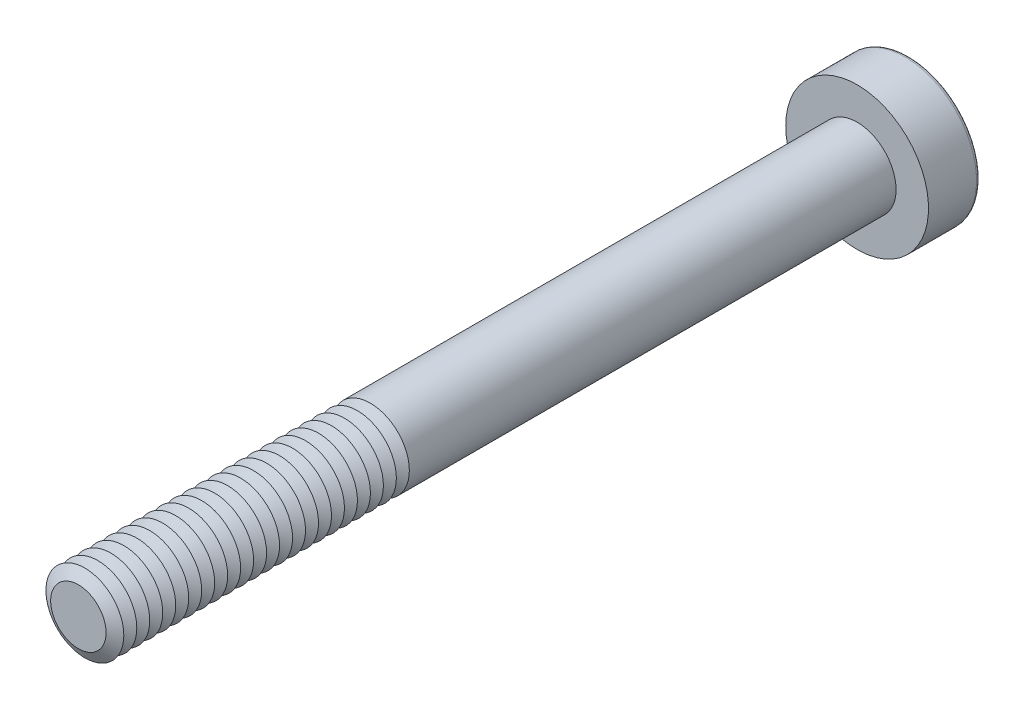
from build123d import *

# Parameters (mm, degrees)
SKETCH1_R           = 1.5
BOSS_EXTRUDE1_DEPTH = 30
SKETCH2_R           = 2.75
BOSS_EXTRUDE2_DEPTH = 2
CUT_EXTRUDE1_DEPTH  = 1.5
FILLET1_R           = 0.15
LPATTERN1_COUNT     = 23
LPATTERN1_PITCH     = 0.5


with BuildPart() as part:
    # Sketch1 → Boss-Extrude1 (new body)
    with BuildSketch(Plane.XY):
        Circle(SKETCH1_R)
    extrude(amount=BOSS_EXTRUDE1_DEPTH)

    # Sketch2 → Boss-Extrude2 (add)
    with BuildSketch(Plane(origin=(0, 0, 0), x_dir=(-1, 0, 0), z_dir=(0, 0, -1))):
        Circle(SKETCH2_R)
    extrude(amount=BOSS_EXTRUDE2_DEPTH)

    # Sketch3 → Cut-Extrude1 (cut)
    with BuildSketch(Plane(origin=(0, 0, -2), x_dir=(-1, 0, 0), z_dir=(0, 0, -1))):
        Polygon((-0.577350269, 1), (-1.154700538, 0), (-0.577350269, -1), (0.577350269, -1), (1.154700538, 0), (0.577350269, 1), align=None)
    extrude(amount=-CUT_EXTRUDE1_DEPTH, mode=Mode.SUBTRACT)

    # Fillet1
    fillet1_edges = [part.edges().sort_by_distance(p)[0] for p in [
        (2.75, 0, -2),
    ]]
    fillet(fillet1_edges, radius=FILLET1_R)

    # Cut-Extrude2 cone 1 section (on through the dimple's axis) → Cut-Extrude2 (revolve, cut)
    with BuildSketch(Plane(origin=(0, 0, -0.5), x_dir=(0, 1, 0), z_dir=(1, 0, 0))):
        Polygon((0, 0), (1, 0), (0, 0.577350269), align=None)
    revolve(axis=Axis((0, 0, -0.5), (0, 0, 1)), mode=Mode.SUBTRACT)

    # Cut-Extrude3 cone 1 section (on through the dimple's axis) → Cut-Extrude3 (revolve, cut)
    with BuildSketch(Plane(origin=(0, 0, -2), x_dir=(0, 1, 0), z_dir=(1, 0, 0))):
        Polygon((0, 0), (1.154700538, 0), (0, 0.309401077), align=None)
    revolve(axis=Axis((0, 0, -2), (0, 0, 1)), mode=Mode.SUBTRACT)

    # Sketch7 → Cut-Revolve1 (revolve, cut)
    with BuildSketch(Plane(origin=(0, 0, 0), x_dir=(0, 0, -1), z_dir=(1, 0, 0)), mode=Mode.PRIVATE) as cut_revolve1_sk:
        Polygon((-30, 1.066987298), (-29.75, 1.5), (-30.25, 1.5), align=None)
    cut_revolve1 = revolve(cut_revolve1_sk.sketch.rotate(Axis((0, 0, 30), (0, 0, -1)), 90), axis=Axis((0, 0, 30), (0, 0, -1)), mode=Mode.SUBTRACT)

    # LPattern1: Cut-Revolve1 ×23
    with Locations(*[(0, 0, -i * LPATTERN1_PITCH) for i in range(1, LPATTERN1_COUNT)]):
        add(cut_revolve1, mode=Mode.SUBTRACT)


solid = part.part
